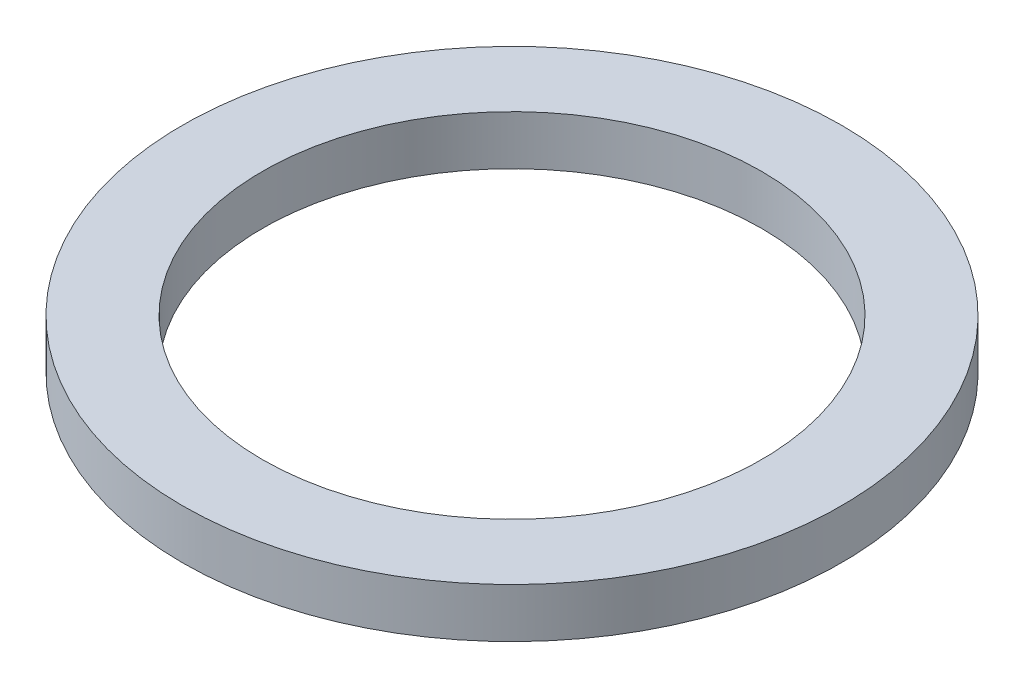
from build123d import *

# Parameters (mm, degrees)
SKETCH1_R           = 20
SKETCH1_R_2         = 15.15
BOSS_EXTRUDE1_DEPTH = 3


with BuildPart() as part:
    # Sketch1 → Boss-Extrude1 (new body)
    with BuildSketch(Plane(origin=(0, 0, 0), x_dir=(1, 0, 0), z_dir=(0, 1, 0))):
        with Locations(Location((0, 0, 0), (0, 0, 270))):
            Circle(SKETCH1_R)
        with Locations(Location((0, 0, 0), (0, 0, 270))):
            Circle(SKETCH1_R_2, mode=Mode.SUBTRACT)
    extrude(amount=BOSS_EXTRUDE1_DEPTH)


solid = part.part
